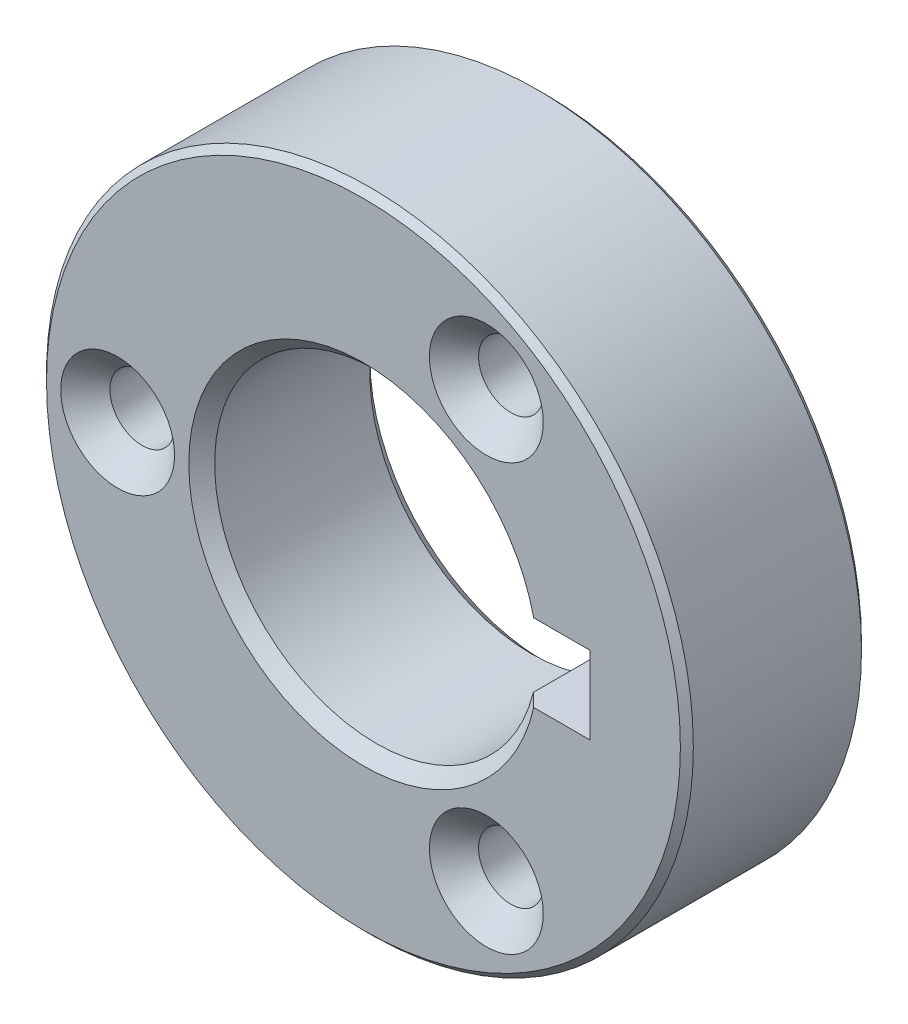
from build123d import *

# Parameters (mm, degrees)
ESQUISSE1_R          = 25
BASE_EXTRUSION_DEPTH = 14
CHANFREIN1_SIZE      = 0.5
CHANFREIN2_SIZE      = 1
PER_AGE1_D           = 5
PER_AGE1_DEPTH       = 6
PER_AGE1_CSINK_D     = 8.8
PER_AGE1_CSINK_ANGLE = 90
PER_AGE1_TIP         = 1.502151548


with BuildPart() as part:
    # Esquisse1 → Base-Extrusion (new body)
    with BuildSketch(Plane.XY):
        Circle(ESQUISSE1_R)
        with BuildLine():
            Line((12.1346611, 3), (17.5, 3))
            Line((17.5, 3), (17.5, -3))
            Line((17.5, -3), (12.1346611, -3))
            ThreePointArc((12.1346611, -3), (-12.5, 0), (12.1346611, 3))
        make_face(mode=Mode.SUBTRACT)
    extrude(amount=BASE_EXTRUSION_DEPTH)

    # Chanfrein1
    chanfrein1_edges = [part.edges().sort_by_distance(p)[0] for p in [
        (-25, 0, 0),
        (-25, 0, 14),
    ]]
    chamfer(chanfrein1_edges, length=CHANFREIN1_SIZE)

    # Chanfrein2
    chanfrein2_edges = [part.edges().sort_by_distance(p)[0] for p in [
        (-12.5, 0, 0),
        (-12.5, 0, 14),
    ]]
    chamfer(chanfrein2_edges, length=CHANFREIN2_SIZE)

    # Per_age1
    with Locations(Plane.XY.offset(14)):
        with Locations((-19, 0), (9.5, 16.454482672), (9.5, -16.454482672)):
            CounterSinkHole(PER_AGE1_D / 2, PER_AGE1_CSINK_D / 2, depth=PER_AGE1_DEPTH, counter_sink_angle=PER_AGE1_CSINK_ANGLE)
            with Locations((0, 0, -(PER_AGE1_DEPTH + PER_AGE1_TIP / 2))):  # 118° drill point
                Cone(0, PER_AGE1_D / 2, PER_AGE1_TIP, mode=Mode.SUBTRACT)


solid = part.part
